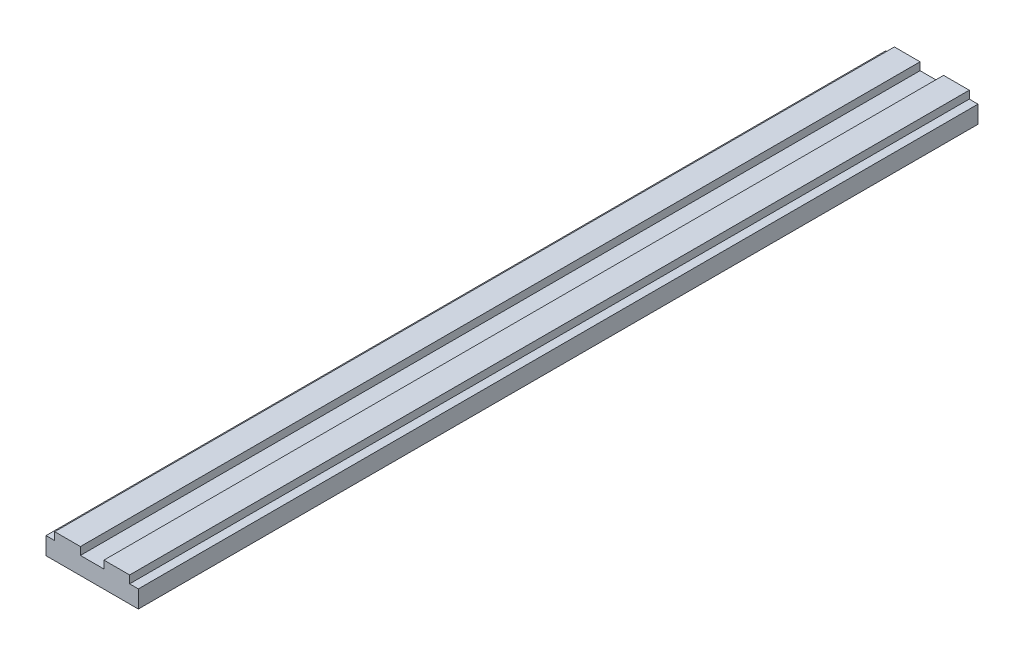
ISO-10303-21;
HEADER;
FILE_DESCRIPTION(('STEP AP214'),'2;1');
FILE_NAME('part.step','',(''),(''),'','','');
FILE_SCHEMA(('AUTOMOTIVE_DESIGN { 1 0 10303 214 1 1 1 1 }'));
ENDSEC;
DATA;
#1=APPLICATION_CONTEXT('core data for automotive mechanical design processes');
#2=APPLICATION_PROTOCOL_DEFINITION('international standard','automotive_design',2000,#1);
#3=PRODUCT_CONTEXT('',#1,'mechanical');
#4=PRODUCT('Part','Part','',(#3));
#5=PRODUCT_RELATED_PRODUCT_CATEGORY('part','',(#4));
#6=PRODUCT_DEFINITION_FORMATION('','',#4);
#7=PRODUCT_DEFINITION_CONTEXT('part definition',#1,'design');
#8=PRODUCT_DEFINITION('design','',#6,#7);
#9=PRODUCT_DEFINITION_SHAPE('','',#8);
#10=(LENGTH_UNIT() NAMED_UNIT(*) SI_UNIT(.MILLI.,.METRE.));
#11=(NAMED_UNIT(*) PLANE_ANGLE_UNIT() SI_UNIT($,.RADIAN.));
#12=(NAMED_UNIT(*) SI_UNIT($,.STERADIAN.) SOLID_ANGLE_UNIT());
#13=UNCERTAINTY_MEASURE_WITH_UNIT(LENGTH_MEASURE(1.E-05),#10,'distance_accuracy_value','');
#14=(GEOMETRIC_REPRESENTATION_CONTEXT(3) GLOBAL_UNCERTAINTY_ASSIGNED_CONTEXT((#13)) GLOBAL_UNIT_ASSIGNED_CONTEXT((#10,
#11,#12)) REPRESENTATION_CONTEXT('',''));
#15=CARTESIAN_POINT('',(0.,0.,0.));
#16=DIRECTION('',(0.,0.,1.));
#17=DIRECTION('',(1.,0.,0.));
#18=AXIS2_PLACEMENT_3D('',#15,#16,#17);
#19=CARTESIAN_POINT('',(22.3,10.4,0.));
#20=DIRECTION('',(1.,0.,0.));
#21=DIRECTION('',(0.,0.,-1.));
#22=AXIS2_PLACEMENT_3D('',#19,#20,#21);
#23=PLANE('',#22);
#24=DIRECTION('',(0.,1.,0.));
#25=VECTOR('',#24,1.);
#26=CARTESIAN_POINT('',(22.3,10.4,500.));
#27=LINE('',#26,#25);
#28=CARTESIAN_POINT('',(22.3,10.4,500.));
#29=VERTEX_POINT('',#28);
#30=CARTESIAN_POINT('',(22.3,15.,500.));
#31=VERTEX_POINT('',#30);
#32=EDGE_CURVE('E134',#29,#31,#27,.T.);
#33=ORIENTED_EDGE('',*,*,#32,.F.);
#34=DIRECTION('',(0.,0.,1.));
#35=VECTOR('',#34,1.);
#36=CARTESIAN_POINT('',(22.3,10.4,0.));
#37=LINE('',#36,#35);
#38=CARTESIAN_POINT('',(22.3,10.4,0.));
#39=VERTEX_POINT('',#38);
#40=EDGE_CURVE('E9',#39,#29,#37,.T.);
#41=ORIENTED_EDGE('',*,*,#40,.F.);
#42=DIRECTION('',(0.,1.,0.));
#43=VECTOR('',#42,1.);
#44=CARTESIAN_POINT('',(22.3,10.4,0.));
#45=LINE('',#44,#43);
#46=CARTESIAN_POINT('',(22.3,15.,0.));
#47=VERTEX_POINT('',#46);
#48=EDGE_CURVE('E160',#39,#47,#45,.T.);
#49=ORIENTED_EDGE('',*,*,#48,.T.);
#50=DIRECTION('',(0.,0.,1.));
#51=VECTOR('',#50,1.);
#52=CARTESIAN_POINT('',(22.3,15.,0.));
#53=LINE('',#52,#51);
#54=EDGE_CURVE('E17',#47,#31,#53,.T.);
#55=ORIENTED_EDGE('',*,*,#54,.T.);
#56=EDGE_LOOP('',(#33,#41,#49,#55));
#57=FACE_BOUND('',#56,.T.);
#58=ADVANCED_FACE('F14',(#57),#23,.T.);
#59=CARTESIAN_POINT('',(22.3,10.4,0.));
#60=DIRECTION('',(0.,-1.,0.));
#61=DIRECTION('',(0.,0.,-1.));
#62=AXIS2_PLACEMENT_3D('',#59,#60,#61);
#63=PLANE('',#62);
#64=DIRECTION('',(1.,0.,0.));
#65=VECTOR('',#64,1.);
#66=CARTESIAN_POINT('',(22.3,10.4,500.));
#67=LINE('',#66,#65);
#68=CARTESIAN_POINT('',(27.5,10.4,500.));
#69=VERTEX_POINT('',#68);
#70=EDGE_CURVE('E159',#29,#69,#67,.T.);
#71=ORIENTED_EDGE('',*,*,#70,.T.);
#72=DIRECTION('',(0.,0.,1.));
#73=VECTOR('',#72,1.);
#74=CARTESIAN_POINT('',(27.5,10.4,0.));
#75=LINE('',#74,#73);
#76=CARTESIAN_POINT('',(27.5,10.4,0.));
#77=VERTEX_POINT('',#76);
#78=EDGE_CURVE('E23',#77,#69,#75,.T.);
#79=ORIENTED_EDGE('',*,*,#78,.F.);
#80=DIRECTION('',(1.,0.,0.));
#81=VECTOR('',#80,1.);
#82=CARTESIAN_POINT('',(22.3,10.4,0.));
#83=LINE('',#82,#81);
#84=EDGE_CURVE('E123',#39,#77,#83,.T.);
#85=ORIENTED_EDGE('',*,*,#84,.F.);
#86=ORIENTED_EDGE('',*,*,#40,.T.);
#87=EDGE_LOOP('',(#71,#79,#85,#86));
#88=FACE_BOUND('',#87,.T.);
#89=ADVANCED_FACE('F188',(#88),#63,.F.);
#90=CARTESIAN_POINT('',(27.5,0.,0.));
#91=DIRECTION('',(1.,0.,0.));
#92=DIRECTION('',(0.,0.,-1.));
#93=AXIS2_PLACEMENT_3D('',#90,#91,#92);
#94=PLANE('',#93);
#95=DIRECTION('',(0.,1.,0.));
#96=VECTOR('',#95,1.);
#97=CARTESIAN_POINT('',(27.5,0.,500.));
#98=LINE('',#97,#96);
#99=CARTESIAN_POINT('',(27.5,0.,500.));
#100=VERTEX_POINT('',#99);
#101=EDGE_CURVE('E113',#100,#69,#98,.T.);
#102=ORIENTED_EDGE('',*,*,#101,.F.);
#103=DIRECTION('',(0.,0.,1.));
#104=VECTOR('',#103,1.);
#105=CARTESIAN_POINT('',(27.5,0.,0.));
#106=LINE('',#105,#104);
#107=CARTESIAN_POINT('',(27.5,0.,0.));
#108=VERTEX_POINT('',#107);
#109=EDGE_CURVE('E108',#108,#100,#106,.T.);
#110=ORIENTED_EDGE('',*,*,#109,.F.);
#111=DIRECTION('',(0.,1.,0.));
#112=VECTOR('',#111,1.);
#113=CARTESIAN_POINT('',(27.5,0.,0.));
#114=LINE('',#113,#112);
#115=EDGE_CURVE('E111',#108,#77,#114,.T.);
#116=ORIENTED_EDGE('',*,*,#115,.T.);
#117=ORIENTED_EDGE('',*,*,#78,.T.);
#118=EDGE_LOOP('',(#102,#110,#116,#117));
#119=FACE_BOUND('',#118,.T.);
#120=ADVANCED_FACE('F110',(#119),#94,.T.);
#121=CARTESIAN_POINT('',(-27.5,0.,0.));
#122=DIRECTION('',(0.,-1.,0.));
#123=DIRECTION('',(0.,0.,-1.));
#124=AXIS2_PLACEMENT_3D('',#121,#122,#123);
#125=PLANE('',#124);
#126=DIRECTION('',(1.,0.,0.));
#127=VECTOR('',#126,1.);
#128=CARTESIAN_POINT('',(-27.5,0.,500.));
#129=LINE('',#128,#127);
#130=CARTESIAN_POINT('',(-27.5,0.,500.));
#131=VERTEX_POINT('',#130);
#132=EDGE_CURVE('E156',#131,#100,#129,.T.);
#133=ORIENTED_EDGE('',*,*,#132,.F.);
#134=DIRECTION('',(0.,0.,1.));
#135=VECTOR('',#134,1.);
#136=CARTESIAN_POINT('',(-27.5,0.,0.));
#137=LINE('',#136,#135);
#138=CARTESIAN_POINT('',(-27.5,0.,0.));
#139=VERTEX_POINT('',#138);
#140=EDGE_CURVE('E118',#139,#131,#137,.T.);
#141=ORIENTED_EDGE('',*,*,#140,.F.);
#142=DIRECTION('',(1.,0.,0.));
#143=VECTOR('',#142,1.);
#144=CARTESIAN_POINT('',(-27.5,0.,0.));
#145=LINE('',#144,#143);
#146=EDGE_CURVE('E122',#139,#108,#145,.T.);
#147=ORIENTED_EDGE('',*,*,#146,.T.);
#148=ORIENTED_EDGE('',*,*,#109,.T.);
#149=EDGE_LOOP('',(#133,#141,#147,#148));
#150=FACE_BOUND('',#149,.T.);
#151=ADVANCED_FACE('F125',(#150),#125,.T.);
#152=CARTESIAN_POINT('',(-27.5,0.,0.));
#153=DIRECTION('',(1.,0.,0.));
#154=DIRECTION('',(0.,0.,-1.));
#155=AXIS2_PLACEMENT_3D('',#152,#153,#154);
#156=PLANE('',#155);
#157=DIRECTION('',(0.,1.,0.));
#158=VECTOR('',#157,1.);
#159=CARTESIAN_POINT('',(-27.5,0.,500.));
#160=LINE('',#159,#158);
#161=CARTESIAN_POINT('',(-27.5,10.4,500.));
#162=VERTEX_POINT('',#161);
#163=EDGE_CURVE('E154',#131,#162,#160,.T.);
#164=ORIENTED_EDGE('',*,*,#163,.T.);
#165=DIRECTION('',(0.,0.,1.));
#166=VECTOR('',#165,1.);
#167=CARTESIAN_POINT('',(-27.5,10.4,0.));
#168=LINE('',#167,#166);
#169=CARTESIAN_POINT('',(-27.5,10.4,0.));
#170=VERTEX_POINT('',#169);
#171=EDGE_CURVE('E164',#170,#162,#168,.T.);
#172=ORIENTED_EDGE('',*,*,#171,.F.);
#173=DIRECTION('',(0.,1.,0.));
#174=VECTOR('',#173,1.);
#175=CARTESIAN_POINT('',(-27.5,0.,0.));
#176=LINE('',#175,#174);
#177=EDGE_CURVE('E127',#139,#170,#176,.T.);
#178=ORIENTED_EDGE('',*,*,#177,.F.);
#179=ORIENTED_EDGE('',*,*,#140,.T.);
#180=EDGE_LOOP('',(#164,#172,#178,#179));
#181=FACE_BOUND('',#180,.T.);
#182=ADVANCED_FACE('F232',(#181),#156,.F.);
#183=CARTESIAN_POINT('',(-27.5,10.4,0.));
#184=DIRECTION('',(0.,-1.,0.));
#185=DIRECTION('',(1.,0.,0.));
#186=AXIS2_PLACEMENT_3D('',#183,#184,#185);
#187=PLANE('',#186);
#188=DIRECTION('',(1.,0.,0.));
#189=VECTOR('',#188,1.);
#190=CARTESIAN_POINT('',(-27.5,10.4,500.));
#191=LINE('',#190,#189);
#192=CARTESIAN_POINT('',(-22.3,10.4,500.));
#193=VERTEX_POINT('',#192);
#194=EDGE_CURVE('E152',#162,#193,#191,.T.);
#195=ORIENTED_EDGE('',*,*,#194,.T.);
#196=DIRECTION('',(0.,0.,1.));
#197=VECTOR('',#196,1.);
#198=CARTESIAN_POINT('',(-22.3,10.4,0.));
#199=LINE('',#198,#197);
#200=CARTESIAN_POINT('',(-22.3,10.4,0.));
#201=VERTEX_POINT('',#200);
#202=EDGE_CURVE('E167',#201,#193,#199,.T.);
#203=ORIENTED_EDGE('',*,*,#202,.F.);
#204=DIRECTION('',(1.,0.,0.));
#205=VECTOR('',#204,1.);
#206=CARTESIAN_POINT('',(-27.5,10.4,0.));
#207=LINE('',#206,#205);
#208=EDGE_CURVE('E129',#170,#201,#207,.T.);
#209=ORIENTED_EDGE('',*,*,#208,.F.);
#210=ORIENTED_EDGE('',*,*,#171,.T.);
#211=EDGE_LOOP('',(#195,#203,#209,#210));
#212=FACE_BOUND('',#211,.T.);
#213=ADVANCED_FACE('F208',(#212),#187,.F.);
#214=CARTESIAN_POINT('',(-22.3,10.4,0.));
#215=DIRECTION('',(1.,0.,0.));
#216=DIRECTION('',(0.,0.,-1.));
#217=AXIS2_PLACEMENT_3D('',#214,#215,#216);
#218=PLANE('',#217);
#219=DIRECTION('',(0.,1.,0.));
#220=VECTOR('',#219,1.);
#221=CARTESIAN_POINT('',(-22.3,10.4,500.));
#222=LINE('',#221,#220);
#223=CARTESIAN_POINT('',(-22.3,15.,500.));
#224=VERTEX_POINT('',#223);
#225=EDGE_CURVE('E150',#193,#224,#222,.T.);
#226=ORIENTED_EDGE('',*,*,#225,.T.);
#227=DIRECTION('',(0.,0.,1.));
#228=VECTOR('',#227,1.);
#229=CARTESIAN_POINT('',(-22.3,15.,0.));
#230=LINE('',#229,#228);
#231=CARTESIAN_POINT('',(-22.3,15.,0.));
#232=VERTEX_POINT('',#231);
#233=EDGE_CURVE('E170',#232,#224,#230,.T.);
#234=ORIENTED_EDGE('',*,*,#233,.F.);
#235=DIRECTION('',(0.,1.,0.));
#236=VECTOR('',#235,1.);
#237=CARTESIAN_POINT('',(-22.3,10.4,0.));
#238=LINE('',#237,#236);
#239=EDGE_CURVE('E201',#201,#232,#238,.T.);
#240=ORIENTED_EDGE('',*,*,#239,.F.);
#241=ORIENTED_EDGE('',*,*,#202,.T.);
#242=EDGE_LOOP('',(#226,#234,#240,#241));
#243=FACE_BOUND('',#242,.T.);
#244=ADVANCED_FACE('F212',(#243),#218,.F.);
#245=CARTESIAN_POINT('',(-22.3,15.,0.));
#246=DIRECTION('',(0.,-1.,0.));
#247=DIRECTION('',(0.,0.,-1.));
#248=AXIS2_PLACEMENT_3D('',#245,#246,#247);
#249=PLANE('',#248);
#250=DIRECTION('',(1.,0.,0.));
#251=VECTOR('',#250,1.);
#252=CARTESIAN_POINT('',(-22.3,15.,500.));
#253=LINE('',#252,#251);
#254=CARTESIAN_POINT('',(-7.,15.,500.));
#255=VERTEX_POINT('',#254);
#256=EDGE_CURVE('E147',#224,#255,#253,.T.);
#257=ORIENTED_EDGE('',*,*,#256,.T.);
#258=DIRECTION('',(0.,0.,1.));
#259=VECTOR('',#258,1.);
#260=CARTESIAN_POINT('',(-7.,15.,0.));
#261=LINE('',#260,#259);
#262=CARTESIAN_POINT('',(-7.,15.,0.));
#263=VERTEX_POINT('',#262);
#264=EDGE_CURVE('E173',#263,#255,#261,.T.);
#265=ORIENTED_EDGE('',*,*,#264,.F.);
#266=DIRECTION('',(1.,0.,0.));
#267=VECTOR('',#266,1.);
#268=CARTESIAN_POINT('',(-22.3,15.,0.));
#269=LINE('',#268,#267);
#270=EDGE_CURVE('E199',#232,#263,#269,.T.);
#271=ORIENTED_EDGE('',*,*,#270,.F.);
#272=ORIENTED_EDGE('',*,*,#233,.T.);
#273=EDGE_LOOP('',(#257,#265,#271,#272));
#274=FACE_BOUND('',#273,.T.);
#275=ADVANCED_FACE('F217',(#274),#249,.F.);
#276=CARTESIAN_POINT('',(-7.,10.4,0.));
#277=DIRECTION('',(1.,0.,0.));
#278=DIRECTION('',(0.,0.,-1.));
#279=AXIS2_PLACEMENT_3D('',#276,#277,#278);
#280=PLANE('',#279);
#281=DIRECTION('',(0.,1.,0.));
#282=VECTOR('',#281,1.);
#283=CARTESIAN_POINT('',(-7.,10.4,500.));
#284=LINE('',#283,#282);
#285=CARTESIAN_POINT('',(-7.,10.4,500.));
#286=VERTEX_POINT('',#285);
#287=EDGE_CURVE('E144',#286,#255,#284,.T.);
#288=ORIENTED_EDGE('',*,*,#287,.F.);
#289=DIRECTION('',(0.,0.,1.));
#290=VECTOR('',#289,1.);
#291=CARTESIAN_POINT('',(-7.,10.4,0.));
#292=LINE('',#291,#290);
#293=CARTESIAN_POINT('',(-7.,10.4,0.));
#294=VERTEX_POINT('',#293);
#295=EDGE_CURVE('E175',#294,#286,#292,.T.);
#296=ORIENTED_EDGE('',*,*,#295,.F.);
#297=DIRECTION('',(0.,1.,0.));
#298=VECTOR('',#297,1.);
#299=CARTESIAN_POINT('',(-7.,10.4,0.));
#300=LINE('',#299,#298);
#301=EDGE_CURVE('E196',#294,#263,#300,.T.);
#302=ORIENTED_EDGE('',*,*,#301,.T.);
#303=ORIENTED_EDGE('',*,*,#264,.T.);
#304=EDGE_LOOP('',(#288,#296,#302,#303));
#305=FACE_BOUND('',#304,.T.);
#306=ADVANCED_FACE('F223',(#305),#280,.T.);
#307=CARTESIAN_POINT('',(-7.,10.4,0.));
#308=DIRECTION('',(0.,-1.,0.));
#309=DIRECTION('',(0.,0.,-1.));
#310=AXIS2_PLACEMENT_3D('',#307,#308,#309);
#311=PLANE('',#310);
#312=DIRECTION('',(1.,0.,0.));
#313=VECTOR('',#312,1.);
#314=CARTESIAN_POINT('',(-7.,10.4,500.));
#315=LINE('',#314,#313);
#316=CARTESIAN_POINT('',(7.,10.4,500.));
#317=VERTEX_POINT('',#316);
#318=EDGE_CURVE('E142',#286,#317,#315,.T.);
#319=ORIENTED_EDGE('',*,*,#318,.T.);
#320=DIRECTION('',(0.,0.,1.));
#321=VECTOR('',#320,1.);
#322=CARTESIAN_POINT('',(7.,10.4,0.));
#323=LINE('',#322,#321);
#324=CARTESIAN_POINT('',(7.,10.4,0.));
#325=VERTEX_POINT('',#324);
#326=EDGE_CURVE('E177',#325,#317,#323,.T.);
#327=ORIENTED_EDGE('',*,*,#326,.F.);
#328=DIRECTION('',(1.,0.,0.));
#329=VECTOR('',#328,1.);
#330=CARTESIAN_POINT('',(-7.,10.4,0.));
#331=LINE('',#330,#329);
#332=EDGE_CURVE('E194',#294,#325,#331,.T.);
#333=ORIENTED_EDGE('',*,*,#332,.F.);
#334=ORIENTED_EDGE('',*,*,#295,.T.);
#335=EDGE_LOOP('',(#319,#327,#333,#334));
#336=FACE_BOUND('',#335,.T.);
#337=ADVANCED_FACE('F226',(#336),#311,.F.);
#338=CARTESIAN_POINT('',(7.,10.4,0.));
#339=DIRECTION('',(1.,0.,0.));
#340=DIRECTION('',(0.,1.,0.));
#341=AXIS2_PLACEMENT_3D('',#338,#339,#340);
#342=PLANE('',#341);
#343=DIRECTION('',(0.,1.,0.));
#344=VECTOR('',#343,1.);
#345=CARTESIAN_POINT('',(7.,10.4,500.));
#346=LINE('',#345,#344);
#347=CARTESIAN_POINT('',(7.,15.,500.));
#348=VERTEX_POINT('',#347);
#349=EDGE_CURVE('E140',#317,#348,#346,.T.);
#350=ORIENTED_EDGE('',*,*,#349,.T.);
#351=DIRECTION('',(0.,0.,1.));
#352=VECTOR('',#351,1.);
#353=CARTESIAN_POINT('',(7.,15.,0.));
#354=LINE('',#353,#352);
#355=CARTESIAN_POINT('',(7.,15.,0.));
#356=VERTEX_POINT('',#355);
#357=EDGE_CURVE('E179',#356,#348,#354,.T.);
#358=ORIENTED_EDGE('',*,*,#357,.F.);
#359=DIRECTION('',(0.,1.,0.));
#360=VECTOR('',#359,1.);
#361=CARTESIAN_POINT('',(7.,10.4,0.));
#362=LINE('',#361,#360);
#363=EDGE_CURVE('E190',#325,#356,#362,.T.);
#364=ORIENTED_EDGE('',*,*,#363,.F.);
#365=ORIENTED_EDGE('',*,*,#326,.T.);
#366=EDGE_LOOP('',(#350,#358,#364,#365));
#367=FACE_BOUND('',#366,.T.);
#368=ADVANCED_FACE('F229',(#367),#342,.F.);
#369=CARTESIAN_POINT('',(7.,15.,0.));
#370=DIRECTION('',(0.,-1.,0.));
#371=DIRECTION('',(0.,0.,-1.));
#372=AXIS2_PLACEMENT_3D('',#369,#370,#371);
#373=PLANE('',#372);
#374=DIRECTION('',(1.,0.,0.));
#375=VECTOR('',#374,1.);
#376=CARTESIAN_POINT('',(7.,15.,500.));
#377=LINE('',#376,#375);
#378=EDGE_CURVE('E137',#348,#31,#377,.T.);
#379=ORIENTED_EDGE('',*,*,#378,.T.);
#380=ORIENTED_EDGE('',*,*,#54,.F.);
#381=DIRECTION('',(1.,0.,0.));
#382=VECTOR('',#381,1.);
#383=CARTESIAN_POINT('',(7.,15.,0.));
#384=LINE('',#383,#382);
#385=EDGE_CURVE('E83',#356,#47,#384,.T.);
#386=ORIENTED_EDGE('',*,*,#385,.F.);
#387=ORIENTED_EDGE('',*,*,#357,.T.);
#388=EDGE_LOOP('',(#379,#380,#386,#387));
#389=FACE_BOUND('',#388,.T.);
#390=ADVANCED_FACE('F184',(#389),#373,.F.);
#391=CARTESIAN_POINT('',(22.3,15.,0.));
#392=DIRECTION('',(0.,0.,-1.));
#393=DIRECTION('',(-1.,0.,0.));
#394=AXIS2_PLACEMENT_3D('',#391,#392,#393);
#395=PLANE('',#394);
#396=ORIENTED_EDGE('',*,*,#48,.F.);
#397=ORIENTED_EDGE('',*,*,#84,.T.);
#398=ORIENTED_EDGE('',*,*,#115,.F.);
#399=ORIENTED_EDGE('',*,*,#146,.F.);
#400=ORIENTED_EDGE('',*,*,#177,.T.);
#401=ORIENTED_EDGE('',*,*,#208,.T.);
#402=ORIENTED_EDGE('',*,*,#239,.T.);
#403=ORIENTED_EDGE('',*,*,#270,.T.);
#404=ORIENTED_EDGE('',*,*,#301,.F.);
#405=ORIENTED_EDGE('',*,*,#332,.T.);
#406=ORIENTED_EDGE('',*,*,#363,.T.);
#407=ORIENTED_EDGE('',*,*,#385,.T.);
#408=EDGE_LOOP('',(#396,#397,#398,#399,#400,#401,#402,#403,#404,#405,#406,#407));
#409=FACE_BOUND('',#408,.T.);
#410=ADVANCED_FACE('F121',(#409),#395,.T.);
#411=CARTESIAN_POINT('',(22.3,15.,500.));
#412=DIRECTION('',(0.,0.,-1.));
#413=DIRECTION('',(-1.,0.,0.));
#414=AXIS2_PLACEMENT_3D('',#411,#412,#413);
#415=PLANE('',#414);
#416=ORIENTED_EDGE('',*,*,#32,.T.);
#417=ORIENTED_EDGE('',*,*,#378,.F.);
#418=ORIENTED_EDGE('',*,*,#349,.F.);
#419=ORIENTED_EDGE('',*,*,#318,.F.);
#420=ORIENTED_EDGE('',*,*,#287,.T.);
#421=ORIENTED_EDGE('',*,*,#256,.F.);
#422=ORIENTED_EDGE('',*,*,#225,.F.);
#423=ORIENTED_EDGE('',*,*,#194,.F.);
#424=ORIENTED_EDGE('',*,*,#163,.F.);
#425=ORIENTED_EDGE('',*,*,#132,.T.);
#426=ORIENTED_EDGE('',*,*,#101,.T.);
#427=ORIENTED_EDGE('',*,*,#70,.F.);
#428=EDGE_LOOP('',(#416,#417,#418,#419,#420,#421,#422,#423,#424,#425,#426,#427));
#429=FACE_BOUND('',#428,.T.);
#430=ADVANCED_FACE('F187',(#429),#415,.F.);
#431=CLOSED_SHELL('',(#58,#89,#120,#151,#182,#213,#244,#275,#306,#337,#368,#390,#410,#430));
#432=MANIFOLD_SOLID_BREP('B1',#431);
#433=ADVANCED_BREP_SHAPE_REPRESENTATION('',(#18,#432),#14);
#434=SHAPE_DEFINITION_REPRESENTATION(#9,#433);
ENDSEC;
END-ISO-10303-21;
